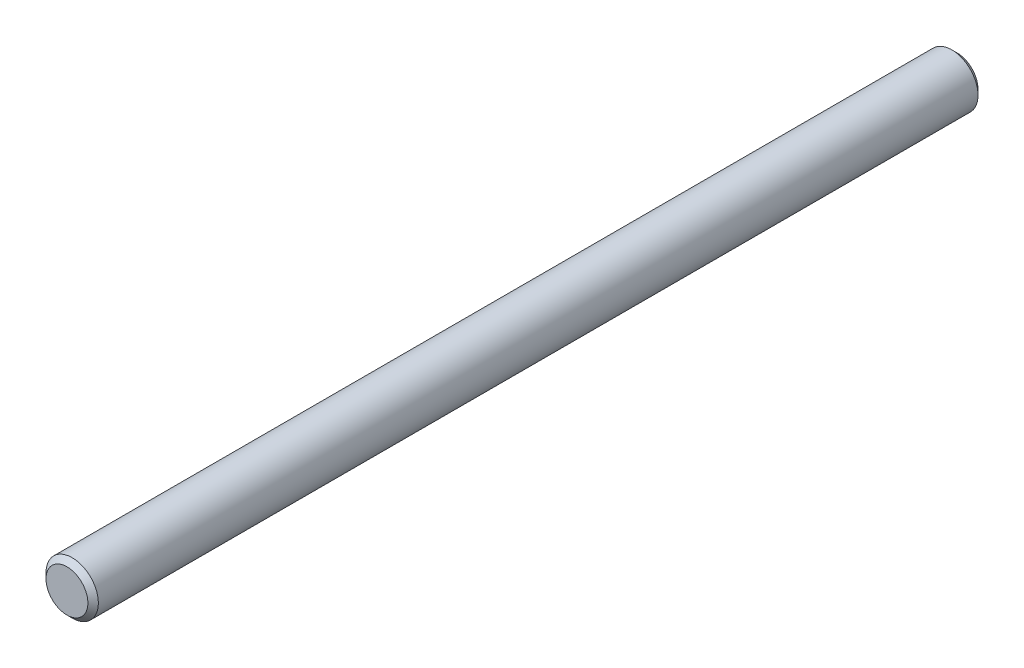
ISO-10303-21;
HEADER;
FILE_DESCRIPTION(('STEP AP214'),'2;1');
FILE_NAME('part.step','',(''),(''),'','','');
FILE_SCHEMA(('AUTOMOTIVE_DESIGN { 1 0 10303 214 1 1 1 1 }'));
ENDSEC;
DATA;
#1=APPLICATION_CONTEXT('core data for automotive mechanical design processes');
#2=APPLICATION_PROTOCOL_DEFINITION('international standard','automotive_design',2000,#1);
#3=PRODUCT_CONTEXT('',#1,'mechanical');
#4=PRODUCT('Part','Part','',(#3));
#5=PRODUCT_RELATED_PRODUCT_CATEGORY('part','',(#4));
#6=PRODUCT_DEFINITION_FORMATION('','',#4);
#7=PRODUCT_DEFINITION_CONTEXT('part definition',#1,'design');
#8=PRODUCT_DEFINITION('design','',#6,#7);
#9=PRODUCT_DEFINITION_SHAPE('','',#8);
#10=(LENGTH_UNIT() NAMED_UNIT(*) SI_UNIT(.MILLI.,.METRE.));
#11=(NAMED_UNIT(*) PLANE_ANGLE_UNIT() SI_UNIT($,.RADIAN.));
#12=(NAMED_UNIT(*) SI_UNIT($,.STERADIAN.) SOLID_ANGLE_UNIT());
#13=UNCERTAINTY_MEASURE_WITH_UNIT(LENGTH_MEASURE(1.E-05),#10,'distance_accuracy_value','');
#14=(GEOMETRIC_REPRESENTATION_CONTEXT(3) GLOBAL_UNCERTAINTY_ASSIGNED_CONTEXT((#13)) GLOBAL_UNIT_ASSIGNED_CONTEXT((#10,
#11,#12)) REPRESENTATION_CONTEXT('',''));
#15=CARTESIAN_POINT('',(0.,0.,0.));
#16=DIRECTION('',(0.,0.,1.));
#17=DIRECTION('',(1.,0.,0.));
#18=AXIS2_PLACEMENT_3D('',#15,#16,#17);
#19=CARTESIAN_POINT('',(0.,0.,170.));
#20=DIRECTION('',(0.,0.,-1.));
#21=DIRECTION('',(-1.,0.,0.));
#22=AXIS2_PLACEMENT_3D('',#19,#20,#21);
#23=CYLINDRICAL_SURFACE('',#22,5.);
#24=CARTESIAN_POINT('',(0.,0.,169.));
#25=DIRECTION('',(0.,0.,1.));
#26=DIRECTION('',(1.,0.,0.));
#27=AXIS2_PLACEMENT_3D('',#24,#25,#26);
#28=CIRCLE('',#27,5.);
#29=CARTESIAN_POINT('',(5.,0.,169.));
#30=VERTEX_POINT('',#29);
#31=EDGE_CURVE('E36',#30,#30,#28,.F.);
#32=ORIENTED_EDGE('',*,*,#31,.T.);
#33=EDGE_LOOP('',(#32));
#34=FACE_BOUND('',#33,.T.);
#35=CARTESIAN_POINT('',(0.,0.,1.));
#36=DIRECTION('',(0.,0.,1.));
#37=DIRECTION('',(1.,0.,0.));
#38=AXIS2_PLACEMENT_3D('',#35,#36,#37);
#39=CIRCLE('',#38,5.);
#40=CARTESIAN_POINT('',(5.,0.,1.));
#41=VERTEX_POINT('',#40);
#42=EDGE_CURVE('E40',#41,#41,#39,.T.);
#43=ORIENTED_EDGE('',*,*,#42,.T.);
#44=EDGE_LOOP('',(#43));
#45=FACE_BOUND('',#44,.T.);
#46=ADVANCED_FACE('F30',(#34,#45),#23,.T.);
#47=CARTESIAN_POINT('',(0.,0.,170.));
#48=DIRECTION('',(0.,0.,1.));
#49=DIRECTION('',(1.,0.,0.));
#50=AXIS2_PLACEMENT_3D('',#47,#48,#49);
#51=PLANE('',#50);
#52=CARTESIAN_POINT('',(0.,0.,170.));
#53=DIRECTION('',(0.,0.,1.));
#54=DIRECTION('',(1.,0.,0.));
#55=AXIS2_PLACEMENT_3D('',#52,#53,#54);
#56=CIRCLE('',#55,3.99999999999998);
#57=CARTESIAN_POINT('',(3.99999999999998,0.,170.));
#58=VERTEX_POINT('',#57);
#59=EDGE_CURVE('E44',#58,#58,#56,.T.);
#60=ORIENTED_EDGE('',*,*,#59,.T.);
#61=EDGE_LOOP('',(#60));
#62=FACE_BOUND('',#61,.T.);
#63=ADVANCED_FACE('F50',(#62),#51,.T.);
#64=CARTESIAN_POINT('',(0.,0.,0.));
#65=DIRECTION('',(0.,0.,1.));
#66=DIRECTION('',(1.,0.,0.));
#67=AXIS2_PLACEMENT_3D('',#64,#65,#66);
#68=PLANE('',#67);
#69=CARTESIAN_POINT('',(0.,0.,0.));
#70=DIRECTION('',(0.,0.,1.));
#71=DIRECTION('',(1.,0.,0.));
#72=AXIS2_PLACEMENT_3D('',#69,#70,#71);
#73=CIRCLE('',#72,3.99999999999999);
#74=CARTESIAN_POINT('',(3.99999999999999,0.,0.));
#75=VERTEX_POINT('',#74);
#76=EDGE_CURVE('E10',#75,#75,#73,.F.);
#77=ORIENTED_EDGE('',*,*,#76,.T.);
#78=EDGE_LOOP('',(#77));
#79=FACE_BOUND('',#78,.T.);
#80=ADVANCED_FACE('F55',(#79),#68,.F.);
#81=CARTESIAN_POINT('',(0.,0.,170.));
#82=DIRECTION('',(0.,0.,-1.));
#83=DIRECTION('',(-1.,0.,0.));
#84=AXIS2_PLACEMENT_3D('',#81,#82,#83);
#85=CONICAL_SURFACE('',#84,3.99999999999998,0.785398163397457);
#86=ORIENTED_EDGE('',*,*,#31,.F.);
#87=EDGE_LOOP('',(#86));
#88=FACE_BOUND('',#87,.T.);
#89=ORIENTED_EDGE('',*,*,#59,.F.);
#90=EDGE_LOOP('',(#89));
#91=FACE_BOUND('',#90,.T.);
#92=ADVANCED_FACE('F52',(#88,#91),#85,.T.);
#93=CARTESIAN_POINT('',(0.,0.,1.));
#94=DIRECTION('',(0.,0.,1.));
#95=DIRECTION('',(1.,0.,0.));
#96=AXIS2_PLACEMENT_3D('',#93,#94,#95);
#97=CONICAL_SURFACE('',#96,5.,0.785398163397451);
#98=ORIENTED_EDGE('',*,*,#76,.F.);
#99=EDGE_LOOP('',(#98));
#100=FACE_BOUND('',#99,.T.);
#101=ORIENTED_EDGE('',*,*,#42,.F.);
#102=EDGE_LOOP('',(#101));
#103=FACE_BOUND('',#102,.T.);
#104=ADVANCED_FACE('F54',(#100,#103),#97,.T.);
#105=CLOSED_SHELL('',(#46,#63,#80,#92,#104));
#106=MANIFOLD_SOLID_BREP('B2',#105);
#107=ADVANCED_BREP_SHAPE_REPRESENTATION('',(#18,#106),#14);
#108=SHAPE_DEFINITION_REPRESENTATION(#9,#107);
ENDSEC;
END-ISO-10303-21;
